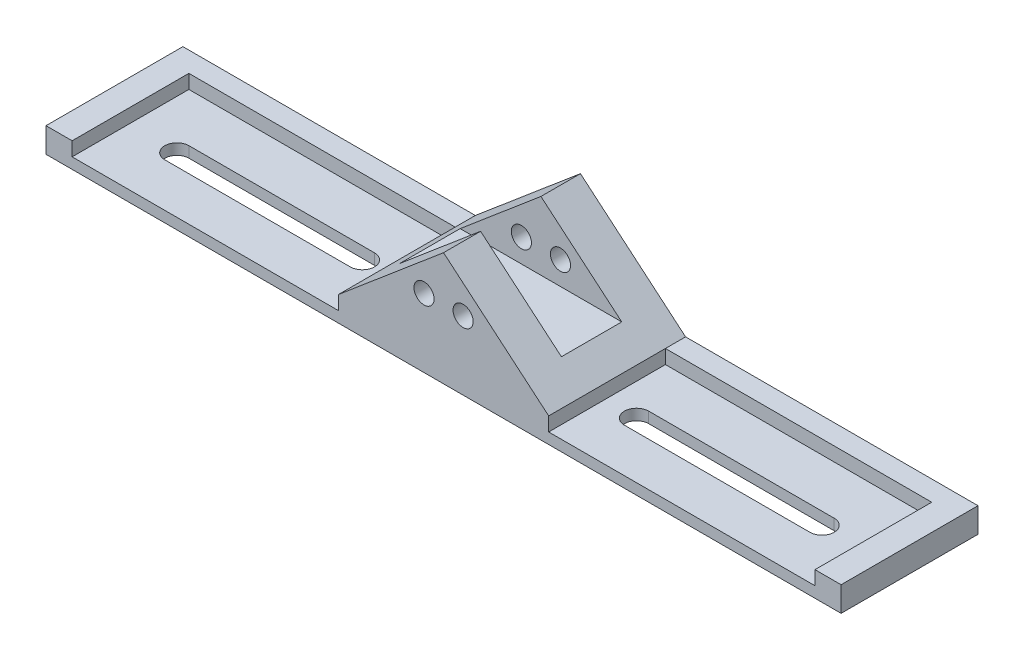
from build123d import *

# Parameters (mm, degrees)
SKETCH1_W          = 296.996513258
SKETCH1_H          = 102.270642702
EXTRUDE1_DEPTH     = 18.542
EXTRUDE2_DEPTH     = 102.270643
SKETCH3_W          = 45.068217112
SKETCH3_H          = 50.984840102
CUT_EXTRUDE1_DEPTH = 314.451690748
SKETCH4_W          = 198.94721367
SKETCH4_H          = 87.220159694
CUT_EXTRUDE2_DEPTH = 10.414
CUT_EXTRUDE3_DEPTH = 245.993263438
SKETCH6_R          = 7.525909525
CUT_EXTRUDE4_DEPTH = 263.58688402


with BuildPart() as part:
    # Sketch1 → Extrude1 (new body)
    with BuildSketch(Plane(origin=(0, 0, 0), x_dir=(1, 0, 0), z_dir=(0, 1, 0))):
        with Locations((77.975135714, 2.181127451)):
            Rectangle(SKETCH1_W, SKETCH1_H)
    extrude(amount=EXTRUDE1_DEPTH)

    # Sketch2 → Extrude2 (add)
    with BuildSketch(Plane.XY.offset(48.9541939)):
        Polygon((8.005729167, 18.542), (-70.523120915, 84.866894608), (-70.523120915, 18.542), align=None)
    extrude(amount=-EXTRUDE2_DEPTH)

    # Sketch3 → Cut-Extrude1 (cut, through all)
    with BuildSketch(Plane.ZY.offset(70.523120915)):
        with Locations((-1.256651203, 59.374474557)):
            Rectangle(SKETCH3_W, SKETCH3_H)
    extrude(amount=-CUT_EXTRUDE1_DEPTH, mode=Mode.SUBTRACT)

    # Sketch4 → Cut-Extrude2 (cut)
    with BuildSketch(Plane(origin=(0, 18.542, 0), x_dir=(-1, 0, 0), z_dir=(0, 1, 0))):
        with Locations((-107.479336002, 5.344114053)):
            Rectangle(SKETCH4_W, SKETCH4_H)
    extrude(amount=-CUT_EXTRUDE2_DEPTH, mode=Mode.SUBTRACT)

    # Sketch5 → Cut-Extrude3 (cut, through all)
    with BuildSketch(Plane(origin=(0, 8.128, 0), x_dir=(-1, 0, 0), z_dir=(0, 1, 0))):
        with BuildLine():
            Line((-170.465352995, 16.26802079), (-31.904335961, 16.26802079))
            ThreePointArc((-31.904335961, 16.26802079), (-22.8163026, 7.17998743), (-31.904335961, -1.908045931))
            Line((-31.904335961, -1.908045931), (-170.465352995, -1.908045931))
            ThreePointArc((-170.465352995, -1.908045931), (-179.553386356, 7.17998743), (-170.465352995, 16.26802079))
        make_face()
    extrude(amount=-CUT_EXTRUDE3_DEPTH, mode=Mode.SUBTRACT)

    # Sketch6 → Cut-Extrude4 (cut, through all)
    with BuildSketch(Plane.XY.offset(48.9541939)):
        with Locations((-55.915954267, 51.27803096)):
            Circle(SKETCH6_R)
    extrude(amount=-CUT_EXTRUDE4_DEPTH, mode=Mode.SUBTRACT)

    # Mirror1: part across plane


with BuildPart() as part_1:
    add(part.part)
    add(part.part.mirror(Plane(origin=(-70.523120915, 18.542, -53.316448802), x_dir=(0, 0, 1), z_dir=(1, 0, 0))))


solid = part_1.part
